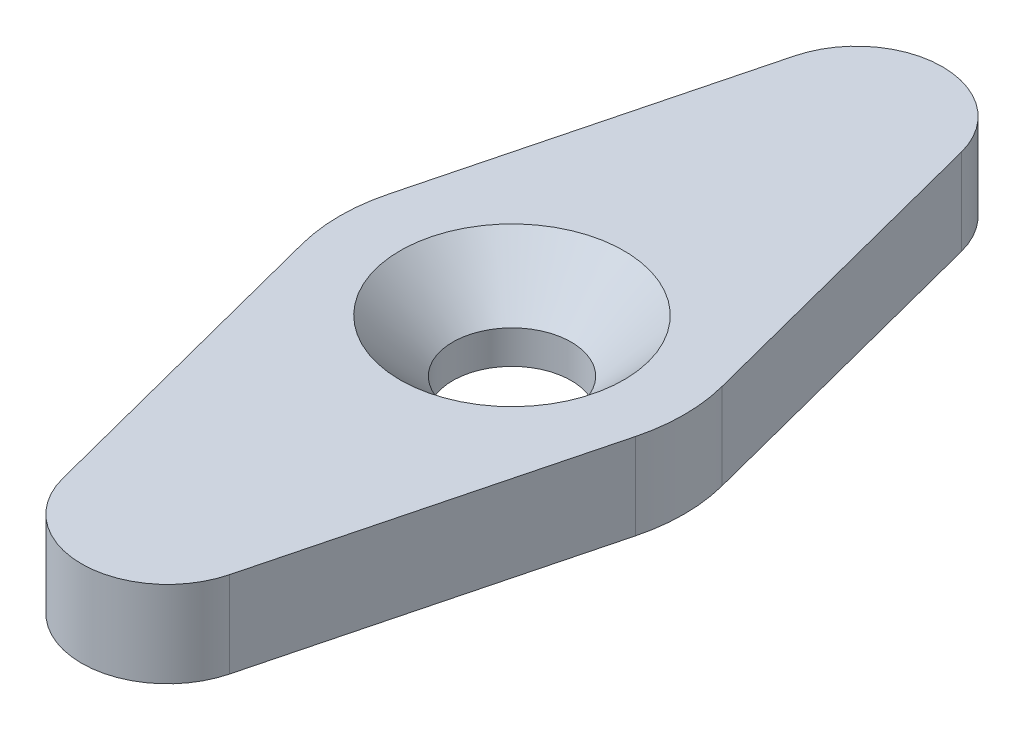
ISO-10303-21;
HEADER;
FILE_DESCRIPTION(('STEP AP214'),'2;1');
FILE_NAME('part.step','',(''),(''),'','','');
FILE_SCHEMA(('AUTOMOTIVE_DESIGN { 1 0 10303 214 1 1 1 1 }'));
ENDSEC;
DATA;
#1=APPLICATION_CONTEXT('core data for automotive mechanical design processes');
#2=APPLICATION_PROTOCOL_DEFINITION('international standard','automotive_design',2000,#1);
#3=PRODUCT_CONTEXT('',#1,'mechanical');
#4=PRODUCT('Part','Part','',(#3));
#5=PRODUCT_RELATED_PRODUCT_CATEGORY('part','',(#4));
#6=PRODUCT_DEFINITION_FORMATION('','',#4);
#7=PRODUCT_DEFINITION_CONTEXT('part definition',#1,'design');
#8=PRODUCT_DEFINITION('design','',#6,#7);
#9=PRODUCT_DEFINITION_SHAPE('','',#8);
#10=(LENGTH_UNIT() NAMED_UNIT(*) SI_UNIT(.MILLI.,.METRE.));
#11=(NAMED_UNIT(*) PLANE_ANGLE_UNIT() SI_UNIT($,.RADIAN.));
#12=(NAMED_UNIT(*) SI_UNIT($,.STERADIAN.) SOLID_ANGLE_UNIT());
#13=UNCERTAINTY_MEASURE_WITH_UNIT(LENGTH_MEASURE(1.E-05),#10,'distance_accuracy_value','');
#14=(GEOMETRIC_REPRESENTATION_CONTEXT(3) GLOBAL_UNCERTAINTY_ASSIGNED_CONTEXT((#13)) GLOBAL_UNIT_ASSIGNED_CONTEXT((#10,
#11,#12)) REPRESENTATION_CONTEXT('',''));
#15=CARTESIAN_POINT('',(0.,0.,0.));
#16=DIRECTION('',(0.,0.,1.));
#17=DIRECTION('',(1.,0.,0.));
#18=AXIS2_PLACEMENT_3D('',#15,#16,#17);
#19=CARTESIAN_POINT('',(0.,4.,16.));
#20=DIRECTION('',(0.,-1.,0.));
#21=DIRECTION('',(0.,0.,-1.));
#22=AXIS2_PLACEMENT_3D('',#19,#20,#21);
#23=CYLINDRICAL_SURFACE('',#22,4.);
#24=CARTESIAN_POINT('',(0.,0.,16.));
#25=DIRECTION('',(0.,1.,0.));
#26=DIRECTION('',(0.,0.,1.));
#27=AXIS2_PLACEMENT_3D('',#24,#25,#26);
#28=CIRCLE('',#27,4.);
#29=CARTESIAN_POINT('',(-3.87298334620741,0.,17.));
#30=VERTEX_POINT('',#29);
#31=CARTESIAN_POINT('',(3.87298334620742,0.,17.));
#32=VERTEX_POINT('',#31);
#33=EDGE_CURVE('E139',#30,#32,#28,.T.);
#34=ORIENTED_EDGE('',*,*,#33,.T.);
#35=DIRECTION('',(0.,-1.,0.));
#36=VECTOR('',#35,1.);
#37=CARTESIAN_POINT('',(3.87298334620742,4.,17.));
#38=LINE('',#37,#36);
#39=CARTESIAN_POINT('',(3.87298334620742,4.,17.));
#40=VERTEX_POINT('',#39);
#41=EDGE_CURVE('E13',#40,#32,#38,.T.);
#42=ORIENTED_EDGE('',*,*,#41,.F.);
#43=CARTESIAN_POINT('',(0.,4.,16.));
#44=DIRECTION('',(0.,1.,0.));
#45=DIRECTION('',(0.,0.,1.));
#46=AXIS2_PLACEMENT_3D('',#43,#44,#45);
#47=CIRCLE('',#46,4.);
#48=CARTESIAN_POINT('',(-3.87298334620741,4.,17.));
#49=VERTEX_POINT('',#48);
#50=EDGE_CURVE('E154',#49,#40,#47,.T.);
#51=ORIENTED_EDGE('',*,*,#50,.F.);
#52=DIRECTION('',(0.,-1.,0.));
#53=VECTOR('',#52,1.);
#54=CARTESIAN_POINT('',(-3.87298334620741,4.,17.));
#55=LINE('',#54,#53);
#56=EDGE_CURVE('E135',#49,#30,#55,.T.);
#57=ORIENTED_EDGE('',*,*,#56,.T.);
#58=EDGE_LOOP('',(#34,#42,#51,#57));
#59=FACE_BOUND('',#58,.T.);
#60=ADVANCED_FACE('F43',(#59),#23,.T.);
#61=CARTESIAN_POINT('',(3.87298334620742,4.,17.));
#62=DIRECTION('',(-0.968245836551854,0.,-0.25));
#63=DIRECTION('',(-0.25,0.,0.968245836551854));
#64=AXIS2_PLACEMENT_3D('',#61,#62,#63);
#65=PLANE('',#64);
#66=DIRECTION('',(0.25,0.,-0.968245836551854));
#67=VECTOR('',#66,1.);
#68=CARTESIAN_POINT('',(3.87298334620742,0.,17.));
#69=LINE('',#68,#67);
#70=CARTESIAN_POINT('',(7.74596669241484,0.,2.));
#71=VERTEX_POINT('',#70);
#72=EDGE_CURVE('E142',#32,#71,#69,.T.);
#73=ORIENTED_EDGE('',*,*,#72,.T.);
#74=DIRECTION('',(0.,-1.,0.));
#75=VECTOR('',#74,1.);
#76=CARTESIAN_POINT('',(7.74596669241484,4.,2.));
#77=LINE('',#76,#75);
#78=CARTESIAN_POINT('',(7.74596669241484,4.,2.));
#79=VERTEX_POINT('',#78);
#80=EDGE_CURVE('E51',#79,#71,#77,.T.);
#81=ORIENTED_EDGE('',*,*,#80,.F.);
#82=DIRECTION('',(0.25,0.,-0.968245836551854));
#83=VECTOR('',#82,1.);
#84=CARTESIAN_POINT('',(3.87298334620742,4.,17.));
#85=LINE('',#84,#83);
#86=EDGE_CURVE('E102',#40,#79,#85,.T.);
#87=ORIENTED_EDGE('',*,*,#86,.F.);
#88=ORIENTED_EDGE('',*,*,#41,.T.);
#89=EDGE_LOOP('',(#73,#81,#87,#88));
#90=FACE_BOUND('',#89,.T.);
#91=ADVANCED_FACE('F211',(#90),#65,.F.);
#92=CARTESIAN_POINT('',(0.,4.,0.));
#93=DIRECTION('',(0.,-1.,0.));
#94=DIRECTION('',(0.,0.,-1.));
#95=AXIS2_PLACEMENT_3D('',#92,#93,#94);
#96=CYLINDRICAL_SURFACE('',#95,8.);
#97=CARTESIAN_POINT('',(0.,0.,0.));
#98=DIRECTION('',(0.,1.,0.));
#99=DIRECTION('',(0.,0.,1.));
#100=AXIS2_PLACEMENT_3D('',#97,#98,#99);
#101=CIRCLE('',#100,8.);
#102=CARTESIAN_POINT('',(7.74596669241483,0.,-2.));
#103=VERTEX_POINT('',#102);
#104=EDGE_CURVE('E145',#71,#103,#101,.T.);
#105=ORIENTED_EDGE('',*,*,#104,.T.);
#106=DIRECTION('',(0.,-1.,0.));
#107=VECTOR('',#106,1.);
#108=CARTESIAN_POINT('',(7.74596669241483,4.,-2.));
#109=LINE('',#108,#107);
#110=CARTESIAN_POINT('',(7.74596669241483,4.,-2.));
#111=VERTEX_POINT('',#110);
#112=EDGE_CURVE('E161',#111,#103,#109,.T.);
#113=ORIENTED_EDGE('',*,*,#112,.F.);
#114=CARTESIAN_POINT('',(0.,4.,0.));
#115=DIRECTION('',(0.,1.,0.));
#116=DIRECTION('',(0.,0.,1.));
#117=AXIS2_PLACEMENT_3D('',#114,#115,#116);
#118=CIRCLE('',#117,8.);
#119=EDGE_CURVE('E169',#79,#111,#118,.T.);
#120=ORIENTED_EDGE('',*,*,#119,.F.);
#121=ORIENTED_EDGE('',*,*,#80,.T.);
#122=EDGE_LOOP('',(#105,#113,#120,#121));
#123=FACE_BOUND('',#122,.T.);
#124=ADVANCED_FACE('F167',(#123),#96,.T.);
#125=CARTESIAN_POINT('',(3.87298334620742,4.,-17.));
#126=DIRECTION('',(-0.968245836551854,0.,0.25));
#127=DIRECTION('',(0.25,0.,0.968245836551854));
#128=AXIS2_PLACEMENT_3D('',#125,#126,#127);
#129=PLANE('',#128);
#130=DIRECTION('',(-0.25,0.,-0.968245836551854));
#131=VECTOR('',#130,1.);
#132=CARTESIAN_POINT('',(3.87298334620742,0.,-17.));
#133=LINE('',#132,#131);
#134=CARTESIAN_POINT('',(3.87298334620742,0.,-17.));
#135=VERTEX_POINT('',#134);
#136=EDGE_CURVE('E147',#103,#135,#133,.T.);
#137=ORIENTED_EDGE('',*,*,#136,.T.);
#138=DIRECTION('',(0.,-1.,0.));
#139=VECTOR('',#138,1.);
#140=CARTESIAN_POINT('',(3.87298334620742,4.,-17.));
#141=LINE('',#140,#139);
#142=CARTESIAN_POINT('',(3.87298334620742,4.,-17.));
#143=VERTEX_POINT('',#142);
#144=EDGE_CURVE('E158',#143,#135,#141,.T.);
#145=ORIENTED_EDGE('',*,*,#144,.F.);
#146=DIRECTION('',(-0.25,0.,-0.968245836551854));
#147=VECTOR('',#146,1.);
#148=CARTESIAN_POINT('',(3.87298334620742,4.,-17.));
#149=LINE('',#148,#147);
#150=EDGE_CURVE('E181',#111,#143,#149,.T.);
#151=ORIENTED_EDGE('',*,*,#150,.F.);
#152=ORIENTED_EDGE('',*,*,#112,.T.);
#153=EDGE_LOOP('',(#137,#145,#151,#152));
#154=FACE_BOUND('',#153,.T.);
#155=ADVANCED_FACE('F177',(#154),#129,.F.);
#156=CARTESIAN_POINT('',(0.,4.,-16.));
#157=DIRECTION('',(0.,-1.,0.));
#158=DIRECTION('',(0.,0.,-1.));
#159=AXIS2_PLACEMENT_3D('',#156,#157,#158);
#160=CYLINDRICAL_SURFACE('',#159,4.);
#161=CARTESIAN_POINT('',(0.,0.,-16.));
#162=DIRECTION('',(0.,1.,0.));
#163=DIRECTION('',(0.,0.,1.));
#164=AXIS2_PLACEMENT_3D('',#161,#162,#163);
#165=CIRCLE('',#164,4.);
#166=CARTESIAN_POINT('',(-3.87298334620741,0.,-17.));
#167=VERTEX_POINT('',#166);
#168=EDGE_CURVE('E149',#135,#167,#165,.T.);
#169=ORIENTED_EDGE('',*,*,#168,.T.);
#170=DIRECTION('',(0.,-1.,0.));
#171=VECTOR('',#170,1.);
#172=CARTESIAN_POINT('',(-3.87298334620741,4.,-17.));
#173=LINE('',#172,#171);
#174=CARTESIAN_POINT('',(-3.87298334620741,4.,-17.));
#175=VERTEX_POINT('',#174);
#176=EDGE_CURVE('E130',#175,#167,#173,.T.);
#177=ORIENTED_EDGE('',*,*,#176,.F.);
#178=CARTESIAN_POINT('',(0.,4.,-16.));
#179=DIRECTION('',(0.,1.,0.));
#180=DIRECTION('',(0.,0.,1.));
#181=AXIS2_PLACEMENT_3D('',#178,#179,#180);
#182=CIRCLE('',#181,4.);
#183=EDGE_CURVE('E121',#143,#175,#182,.T.);
#184=ORIENTED_EDGE('',*,*,#183,.F.);
#185=ORIENTED_EDGE('',*,*,#144,.T.);
#186=EDGE_LOOP('',(#169,#177,#184,#185));
#187=FACE_BOUND('',#186,.T.);
#188=ADVANCED_FACE('F180',(#187),#160,.T.);
#189=CARTESIAN_POINT('',(-3.87298334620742,4.,-17.));
#190=DIRECTION('',(0.968245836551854,0.,0.25));
#191=DIRECTION('',(0.25,0.,-0.968245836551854));
#192=AXIS2_PLACEMENT_3D('',#189,#190,#191);
#193=PLANE('',#192);
#194=DIRECTION('',(-0.25,0.,0.968245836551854));
#195=VECTOR('',#194,1.);
#196=CARTESIAN_POINT('',(-3.87298334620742,0.,-17.));
#197=LINE('',#196,#195);
#198=CARTESIAN_POINT('',(-7.74596669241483,0.,-2.));
#199=VERTEX_POINT('',#198);
#200=EDGE_CURVE('E129',#167,#199,#197,.T.);
#201=ORIENTED_EDGE('',*,*,#200,.T.);
#202=DIRECTION('',(0.,-1.,0.));
#203=VECTOR('',#202,1.);
#204=CARTESIAN_POINT('',(-7.74596669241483,4.,-2.));
#205=LINE('',#204,#203);
#206=CARTESIAN_POINT('',(-7.74596669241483,4.,-2.));
#207=VERTEX_POINT('',#206);
#208=EDGE_CURVE('E126',#207,#199,#205,.T.);
#209=ORIENTED_EDGE('',*,*,#208,.F.);
#210=DIRECTION('',(-0.25,0.,0.968245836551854));
#211=VECTOR('',#210,1.);
#212=CARTESIAN_POINT('',(-3.87298334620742,4.,-17.));
#213=LINE('',#212,#211);
#214=EDGE_CURVE('E115',#175,#207,#213,.T.);
#215=ORIENTED_EDGE('',*,*,#214,.F.);
#216=ORIENTED_EDGE('',*,*,#176,.T.);
#217=EDGE_LOOP('',(#201,#209,#215,#216));
#218=FACE_BOUND('',#217,.T.);
#219=ADVANCED_FACE('F127',(#218),#193,.F.);
#220=CARTESIAN_POINT('',(0.,4.,0.));
#221=DIRECTION('',(0.,-1.,0.));
#222=DIRECTION('',(0.,0.,-1.));
#223=AXIS2_PLACEMENT_3D('',#220,#221,#222);
#224=CYLINDRICAL_SURFACE('',#223,8.);
#225=CARTESIAN_POINT('',(0.,0.,0.));
#226=DIRECTION('',(0.,1.,0.));
#227=DIRECTION('',(0.,0.,1.));
#228=AXIS2_PLACEMENT_3D('',#225,#226,#227);
#229=CIRCLE('',#228,8.);
#230=CARTESIAN_POINT('',(-7.74596669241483,0.,2.));
#231=VERTEX_POINT('',#230);
#232=EDGE_CURVE('E88',#199,#231,#229,.T.);
#233=ORIENTED_EDGE('',*,*,#232,.T.);
#234=DIRECTION('',(0.,-1.,0.));
#235=VECTOR('',#234,1.);
#236=CARTESIAN_POINT('',(-7.74596669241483,4.,2.));
#237=LINE('',#236,#235);
#238=CARTESIAN_POINT('',(-7.74596669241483,4.,2.));
#239=VERTEX_POINT('',#238);
#240=EDGE_CURVE('E131',#239,#231,#237,.T.);
#241=ORIENTED_EDGE('',*,*,#240,.F.);
#242=CARTESIAN_POINT('',(0.,4.,0.));
#243=DIRECTION('',(0.,1.,0.));
#244=DIRECTION('',(0.,0.,1.));
#245=AXIS2_PLACEMENT_3D('',#242,#243,#244);
#246=CIRCLE('',#245,8.);
#247=EDGE_CURVE('E119',#207,#239,#246,.T.);
#248=ORIENTED_EDGE('',*,*,#247,.F.);
#249=ORIENTED_EDGE('',*,*,#208,.T.);
#250=EDGE_LOOP('',(#233,#241,#248,#249));
#251=FACE_BOUND('',#250,.T.);
#252=ADVANCED_FACE('F133',(#251),#224,.T.);
#253=CARTESIAN_POINT('',(-3.87298334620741,4.,17.));
#254=DIRECTION('',(0.968245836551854,0.,-0.25));
#255=DIRECTION('',(-0.25,0.,-0.968245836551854));
#256=AXIS2_PLACEMENT_3D('',#253,#254,#255);
#257=PLANE('',#256);
#258=DIRECTION('',(0.25,0.,0.968245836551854));
#259=VECTOR('',#258,1.);
#260=CARTESIAN_POINT('',(-3.87298334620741,0.,17.));
#261=LINE('',#260,#259);
#262=EDGE_CURVE('E94',#231,#30,#261,.T.);
#263=ORIENTED_EDGE('',*,*,#262,.T.);
#264=ORIENTED_EDGE('',*,*,#56,.F.);
#265=DIRECTION('',(0.25,0.,0.968245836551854));
#266=VECTOR('',#265,1.);
#267=CARTESIAN_POINT('',(-3.87298334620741,4.,17.));
#268=LINE('',#267,#266);
#269=EDGE_CURVE('E59',#239,#49,#268,.T.);
#270=ORIENTED_EDGE('',*,*,#269,.F.);
#271=ORIENTED_EDGE('',*,*,#240,.T.);
#272=EDGE_LOOP('',(#263,#264,#270,#271));
#273=FACE_BOUND('',#272,.T.);
#274=ADVANCED_FACE('F199',(#273),#257,.F.);
#275=CARTESIAN_POINT('',(0.,4.,16.));
#276=DIRECTION('',(0.,1.,0.));
#277=DIRECTION('',(0.,0.,1.));
#278=AXIS2_PLACEMENT_3D('',#275,#276,#277);
#279=PLANE('',#278);
#280=CARTESIAN_POINT('',(0.,4.,0.));
#281=DIRECTION('',(0.,1.,0.));
#282=DIRECTION('',(0.,0.,1.));
#283=AXIS2_PLACEMENT_3D('',#280,#281,#282);
#284=CIRCLE('',#283,5.2);
#285=CARTESIAN_POINT('',(0.,4.,5.2));
#286=VERTEX_POINT('',#285);
#287=EDGE_CURVE('E192',#286,#286,#284,.T.);
#288=ORIENTED_EDGE('',*,*,#287,.F.);
#289=EDGE_LOOP('',(#288));
#290=FACE_BOUND('',#289,.T.);
#291=ORIENTED_EDGE('',*,*,#50,.T.);
#292=ORIENTED_EDGE('',*,*,#86,.T.);
#293=ORIENTED_EDGE('',*,*,#119,.T.);
#294=ORIENTED_EDGE('',*,*,#150,.T.);
#295=ORIENTED_EDGE('',*,*,#183,.T.);
#296=ORIENTED_EDGE('',*,*,#214,.T.);
#297=ORIENTED_EDGE('',*,*,#247,.T.);
#298=ORIENTED_EDGE('',*,*,#269,.T.);
#299=EDGE_LOOP('',(#291,#292,#293,#294,#295,#296,#297,#298));
#300=FACE_BOUND('',#299,.T.);
#301=ADVANCED_FACE('F117',(#290,#300),#279,.T.);
#302=CARTESIAN_POINT('',(0.,0.,16.));
#303=DIRECTION('',(0.,1.,0.));
#304=DIRECTION('',(0.,0.,1.));
#305=AXIS2_PLACEMENT_3D('',#302,#303,#304);
#306=PLANE('',#305);
#307=CARTESIAN_POINT('',(0.,0.,0.));
#308=DIRECTION('',(0.,1.,0.));
#309=DIRECTION('',(0.,0.,1.));
#310=AXIS2_PLACEMENT_3D('',#307,#308,#309);
#311=CIRCLE('',#310,2.75);
#312=CARTESIAN_POINT('',(0.,0.,2.75));
#313=VERTEX_POINT('',#312);
#314=EDGE_CURVE('E143',#313,#313,#311,.T.);
#315=ORIENTED_EDGE('',*,*,#314,.T.);
#316=EDGE_LOOP('',(#315));
#317=FACE_BOUND('',#316,.T.);
#318=ORIENTED_EDGE('',*,*,#33,.F.);
#319=ORIENTED_EDGE('',*,*,#262,.F.);
#320=ORIENTED_EDGE('',*,*,#232,.F.);
#321=ORIENTED_EDGE('',*,*,#200,.F.);
#322=ORIENTED_EDGE('',*,*,#168,.F.);
#323=ORIENTED_EDGE('',*,*,#136,.F.);
#324=ORIENTED_EDGE('',*,*,#104,.F.);
#325=ORIENTED_EDGE('',*,*,#72,.F.);
#326=EDGE_LOOP('',(#318,#319,#320,#321,#322,#323,#324,#325));
#327=FACE_BOUND('',#326,.T.);
#328=ADVANCED_FACE('F173',(#317,#327),#306,.F.);
#329=CARTESIAN_POINT('',(0.,4.,0.));
#330=DIRECTION('',(0.,1.,0.));
#331=DIRECTION('',(0.,0.,1.));
#332=AXIS2_PLACEMENT_3D('',#329,#330,#331);
#333=CYLINDRICAL_SURFACE('',#332,2.75);
#334=ORIENTED_EDGE('',*,*,#314,.F.);
#335=EDGE_LOOP('',(#334));
#336=FACE_BOUND('',#335,.T.);
#337=CARTESIAN_POINT('',(0.,1.55,0.));
#338=DIRECTION('',(0.,1.,0.));
#339=DIRECTION('',(0.,0.,1.));
#340=AXIS2_PLACEMENT_3D('',#337,#338,#339);
#341=CIRCLE('',#340,2.75);
#342=CARTESIAN_POINT('',(0.,1.55,2.75));
#343=VERTEX_POINT('',#342);
#344=EDGE_CURVE('E189',#343,#343,#341,.T.);
#345=ORIENTED_EDGE('',*,*,#344,.T.);
#346=EDGE_LOOP('',(#345));
#347=FACE_BOUND('',#346,.T.);
#348=ADVANCED_FACE('F205',(#336,#347),#333,.F.);
#349=CARTESIAN_POINT('',(0.,4.,0.));
#350=DIRECTION('',(0.,1.,0.));
#351=DIRECTION('',(0.,0.,1.));
#352=AXIS2_PLACEMENT_3D('',#349,#350,#351);
#353=CONICAL_SURFACE('',#352,5.2,0.785398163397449);
#354=ORIENTED_EDGE('',*,*,#344,.F.);
#355=EDGE_LOOP('',(#354));
#356=FACE_BOUND('',#355,.T.);
#357=ORIENTED_EDGE('',*,*,#287,.T.);
#358=EDGE_LOOP('',(#357));
#359=FACE_BOUND('',#358,.T.);
#360=ADVANCED_FACE('F196',(#356,#359),#353,.F.);
#361=CLOSED_SHELL('',(#60,#91,#124,#155,#188,#219,#252,#274,#301,#328,#348,#360));
#362=MANIFOLD_SOLID_BREP('B2',#361);
#363=ADVANCED_BREP_SHAPE_REPRESENTATION('',(#18,#362),#14);
#364=SHAPE_DEFINITION_REPRESENTATION(#9,#363);
ENDSEC;
END-ISO-10303-21;
